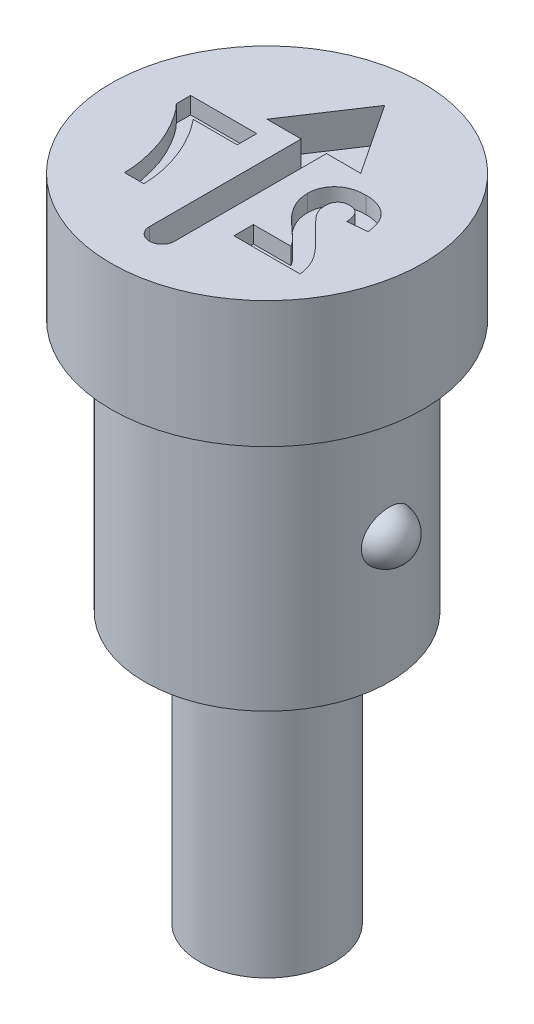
from build123d import *

# Parameters (mm, degrees)
CUT_EXTRUDE1_DEPTH = 0.4
CUT_EXTRUDE2_DEPTH = 0.2


with BuildPart() as part:
    # Sketch1 → Revolve1 (revolve)
    with BuildSketch(Plane.XY, mode=Mode.PRIVATE) as revolve1_sk:
        Polygon((0, 0), (-1.85, 0), (-1.85, -1.5), (-1.45, -1.5), (-1.45, -4.5), (-0.8, -4.5), (-0.8, -7.7), (0, -7.7), align=None)
    revolve(revolve1_sk.sketch.rotate(Axis((0, 0, 0), (0, -1, 0)), 270), axis=Axis((0, 0, 0), (0, -1, 0)))

    # Sketch3 → Cut-Extrude1 (cut)
    with BuildSketch(Plane(origin=(0, 0, 0), x_dir=(1, 0, 0), z_dir=(0, 1, 0))):
        with BuildLine():
            Line((0, 1.395), (-0.555983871, 0.555))
            Line((-0.555983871, 0.555), (-0.15, 0.555))
            Line((-0.15, 0.555), (-0.15, -1.245))
            ThreePointArc((-0.15, -1.245), (0, -1.395), (0.15, -1.245))
            Line((0.15, -1.245), (0.15, 0.555))
            Line((0.15, 0.555), (0.555983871, 0.555))
            Line((0.555983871, 0.555), (0, 1.395))
        make_face()
    extrude(amount=-CUT_EXTRUDE1_DEPTH, mode=Mode.SUBTRACT)

    # Sketch4 → Cut-Extrude2 (cut)
    with BuildSketch(Plane(origin=(0, 0, 0), x_dir=(1, 0, 0), z_dir=(0, 1, 0))):
        with BuildLine():
            Line((0.445305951, -0.607325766), (0.445305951, -0.838094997))
            Line((0.445305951, -0.838094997), (1.229921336, -0.838094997))
            add(Edge.make_bspline(
                [(1.229921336, -0.838094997), (1.22726481, -0.818372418), (1.221953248, -0.778938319), (1.205531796, -0.721335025), (1.183614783, -0.665124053), (1.159828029, -0.619381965), (1.136169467, -0.582561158), (1.114704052, -0.552389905), (1.089096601, -0.520288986), (1.059718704, -0.485999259), (1.026732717, -0.449413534), (0.989892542, -0.41066783), (0.949022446, -0.369947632), (0.920269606, -0.342296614), (0.905402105, -0.327998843)],
                knots=[0, 0, 0, 0, 1.156289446, 2.311930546, 3.473459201, 4.661751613, 5.303057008, 6.018253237, 6.81459331, 7.690699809, 8.644447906, 9.679642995, 10.800191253, 12, 12, 12, 12], degree=3))
            add(Edge.make_bspline(
                [(0.905402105, -0.327998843), (0.89353767, -0.316546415), (0.870951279, -0.294744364), (0.838788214, -0.263524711), (0.810513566, -0.234824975), (0.785536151, -0.209388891), (0.764432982, -0.186568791), (0.746926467, -0.166723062), (0.732794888, -0.149770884), (0.725141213, -0.139016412), (0.721748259, -0.134248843)],
                knots=[0, 0, 0, 0, 1.480720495, 2.818855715, 4.024636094, 5.098235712, 6.019786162, 6.815086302, 7.474715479, 8, 8, 8, 8], degree=3))
            add(Edge.make_bspline(
                [(0.721748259, -0.134248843), (0.714800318, -0.122707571), (0.701398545, -0.100445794), (0.686702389, -0.065438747), (0.677881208, -0.030438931), (0.676670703, -0.007052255), (0.676075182, 0.00445308)],
                knots=[0, 0, 0, 0, 1.0911822, 2.104764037, 3.067617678, 4, 4, 4, 4], degree=3))
            add(Edge.make_bspline(
                [(0.676075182, 0.00445308), (0.676507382, 0.016425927), (0.677325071, 0.039077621), (0.684181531, 0.071043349), (0.696340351, 0.098522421), (0.713080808, 0.121599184), (0.73424915, 0.139679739), (0.758995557, 0.153039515), (0.787682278, 0.160425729), (0.807844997, 0.161397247), (0.818382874, 0.161905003)],
                knots=[0, 0, 0, 0, 1.193122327, 2.257294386, 3.237245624, 4.168877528, 5.075331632, 5.990371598, 6.949684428, 8, 8, 8, 8], degree=3))
            add(Edge.make_bspline(
                [(0.818382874, 0.161905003), (0.828849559, 0.161430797), (0.849068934, 0.160514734), (0.877805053, 0.15251213), (0.902943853, 0.138658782), (0.920859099, 0.122871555), (0.932961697, 0.107519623), (0.941207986, 0.094141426), (0.948315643, 0.078939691), (0.95461362, 0.062085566), (0.959588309, 0.043385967), (0.963594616, 0.022983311), (0.966823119, 0.000767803), (0.96784984, -0.01468689), (0.968382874, -0.022710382)],
                knots=[0, 0, 0, 0, 1.402788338, 2.709884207, 3.961032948, 5.225417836, 5.883680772, 6.578928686, 7.329201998, 8.132101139, 8.990263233, 9.922304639, 10.921339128, 12, 12, 12, 12], degree=3))
            Line((0.968382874, -0.022710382), (1.199152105, -0.000114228))
            add(Edge.make_bspline(
                [(1.199152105, -0.000114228), (1.197296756, 0.015465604), (1.193699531, 0.045672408), (1.184722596, 0.089059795), (1.17335364, 0.129086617), (1.159050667, 0.165678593), (1.142404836, 0.199068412), (1.122567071, 0.228755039), (1.100230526, 0.255067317), (1.075375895, 0.277991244), (1.048161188, 0.297599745), (1.019604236, 0.315103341), (0.989146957, 0.329461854), (0.957124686, 0.341295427), (0.923551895, 0.350752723), (0.888273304, 0.357005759), (0.851506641, 0.361404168), (0.826409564, 0.361735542), (0.813575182, 0.361905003)],
                knots=[0, 0, 0, 0, 1.270971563, 2.464210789, 3.586263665, 4.638946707, 5.643716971, 6.603612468, 7.52484387, 8.434700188, 9.336036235, 10.239171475, 11.145359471, 12.059630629, 13.003312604, 13.96741569, 14.960557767, 16, 16, 16, 16], degree=3))
            add(Edge.make_bspline(
                [(0.813575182, 0.361905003), (0.799622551, 0.36163684), (0.772448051, 0.361114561), (0.732778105, 0.35680157), (0.69551104, 0.349281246), (0.660321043, 0.339319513), (0.627569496, 0.32601987), (0.59698348, 0.309941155), (0.569044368, 0.290473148), (0.543335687, 0.268677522), (0.520354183, 0.244709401), (0.500224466, 0.219143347), (0.483359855, 0.191997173), (0.469207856, 0.163601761), (0.458700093, 0.133500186), (0.451043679, 0.102108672), (0.445967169, 0.06928077), (0.445528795, 0.046860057), (0.445305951, 0.035462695)],
                knots=[0, 0, 0, 0, 1.210756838, 2.35810096, 3.457354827, 4.507168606, 5.527358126, 6.519769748, 7.499700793, 8.476517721, 9.440526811, 10.376769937, 11.295256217, 12.209626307, 13.124630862, 14.055668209, 15.011616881, 16, 16, 16, 16], degree=3))
            add(Edge.make_bspline(
                [(0.445305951, 0.035462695), (0.445599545, 0.022382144), (0.446181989, -0.003567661), (0.451758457, -0.041929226), (0.460278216, -0.079406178), (0.472869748, -0.116090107), (0.488830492, -0.152860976), (0.509404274, -0.18980132), (0.533291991, -0.228025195), (0.551995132, -0.252738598), (0.561652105, -0.265498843)],
                knots=[0, 0, 0, 0, 0.953409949, 1.89141903, 2.821310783, 3.752688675, 4.715703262, 5.740811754, 6.833515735, 8, 8, 8, 8], degree=3))
            add(Edge.make_bspline(
                [(0.561652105, -0.265498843), (0.565302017, -0.270095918), (0.573119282, -0.279941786), (0.586418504, -0.295038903), (0.601831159, -0.311529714), (0.619139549, -0.329722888), (0.638915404, -0.348974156), (0.660447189, -0.370088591), (0.684682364, -0.39198612), (0.709784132, -0.415212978), (0.73499501, -0.437819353), (0.758167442, -0.459290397), (0.77921572, -0.47828766), (0.797159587, -0.495859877), (0.813054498, -0.510807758), (0.826327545, -0.523897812), (0.837227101, -0.534813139), (0.852245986, -0.551827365), (0.871355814, -0.574839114), (0.88480036, -0.59682749), (0.891219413, -0.607325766)],
                knots=[0, 0, 0, 0, 0.665555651, 1.425465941, 2.280616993, 3.225313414, 4.272635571, 5.410053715, 6.644756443, 7.976022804, 9.288331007, 10.484517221, 11.558462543, 12.503158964, 13.33222979, 14.032602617, 14.617328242, 15.080653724, 16.606167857, 18, 18, 18, 18], degree=3))
            Line((0.891219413, -0.607325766), (0.445305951, -0.607325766))
        make_face()
        with BuildLine():
            Line((-0.468540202, 0.115751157), (-0.468540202, 0.346520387))
            Line((-0.468540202, 0.346520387), (-1.253155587, 0.346520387))
            Line((-1.253155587, 0.346520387), (-1.253155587, 0.177289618))
            add(Edge.make_bspline(
                [(-1.253155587, 0.177289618), (-1.244970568, 0.168961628), (-1.22814452, 0.151841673), (-1.204042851, 0.123823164), (-1.179584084, 0.093418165), (-1.155279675, 0.06021697), (-1.130374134, 0.024744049), (-1.105961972, -0.013680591), (-1.081202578, -0.054558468), (-1.047868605, -0.112380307), (-1.008905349, -0.187913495), (-0.967684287, -0.281805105), (-0.932565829, -0.378580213), (-0.90851825, -0.461039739), (-0.89227024, -0.527130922), (-0.881654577, -0.575458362), (-0.872718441, -0.622425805), (-0.8654489, -0.668115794), (-0.860023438, -0.712549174), (-0.855736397, -0.755571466), (-0.853621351, -0.797287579), (-0.853309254, -0.824631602), (-0.853155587, -0.838094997)],
                knots=[0, 0, 0, 0, 0.628545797, 1.29210959, 1.98878689, 2.729126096, 3.507039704, 4.322017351, 5.179550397, 6.080149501, 7.915136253, 9.752312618, 11.597470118, 13.454141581, 14.373891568, 15.261584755, 16.117868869, 16.947726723, 17.752002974, 18.527724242, 19.275094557, 20, 20, 20, 20], degree=3))
            Line((-0.853155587, -0.838094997), (-0.622386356, -0.838094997))
            add(Edge.make_bspline(
                [(-0.622386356, -0.838094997), (-0.623157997, -0.817651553), (-0.624709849, -0.776537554), (-0.630516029, -0.714826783), (-0.639635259, -0.652886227), (-0.650961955, -0.590572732), (-0.665916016, -0.528037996), (-0.682983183, -0.465050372), (-0.703657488, -0.401946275), (-0.72683283, -0.338846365), (-0.752417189, -0.276349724), (-0.780300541, -0.215231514), (-0.810410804, -0.155873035), (-0.8423564, -0.098065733), (-0.87650897, -0.041995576), (-0.912894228, 0.012276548), (-0.950996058, 0.065143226), (-0.978239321, 0.098884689), (-0.99185751, 0.115751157)],
                knots=[0, 0, 0, 0, 0.943249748, 1.896978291, 2.856365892, 3.829648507, 4.816416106, 5.820376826, 6.838120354, 7.877341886, 8.919613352, 9.951365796, 10.974227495, 11.988073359, 12.996274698, 14.000568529, 15.000536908, 16, 16, 16, 16], degree=3))
            Line((-0.99185751, 0.115751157), (-0.468540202, 0.115751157))
        make_face()
    extrude(amount=-CUT_EXTRUDE2_DEPTH, mode=Mode.SUBTRACT)

    # Sketch5 → Revolve2 (revolve)
    with BuildSketch(Plane.XY):
        with BuildLine():
            Line((1.405113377, -2.7), (1.405113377, -3.3))
            ThreePointArc((1.405113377, -3.3), (1.705113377, -3), (1.405113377, -2.7))
        make_face()
    revolve(axis=Axis((1.405113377, -2.7, 0), (0, -1, 0)))


solid = part.part
